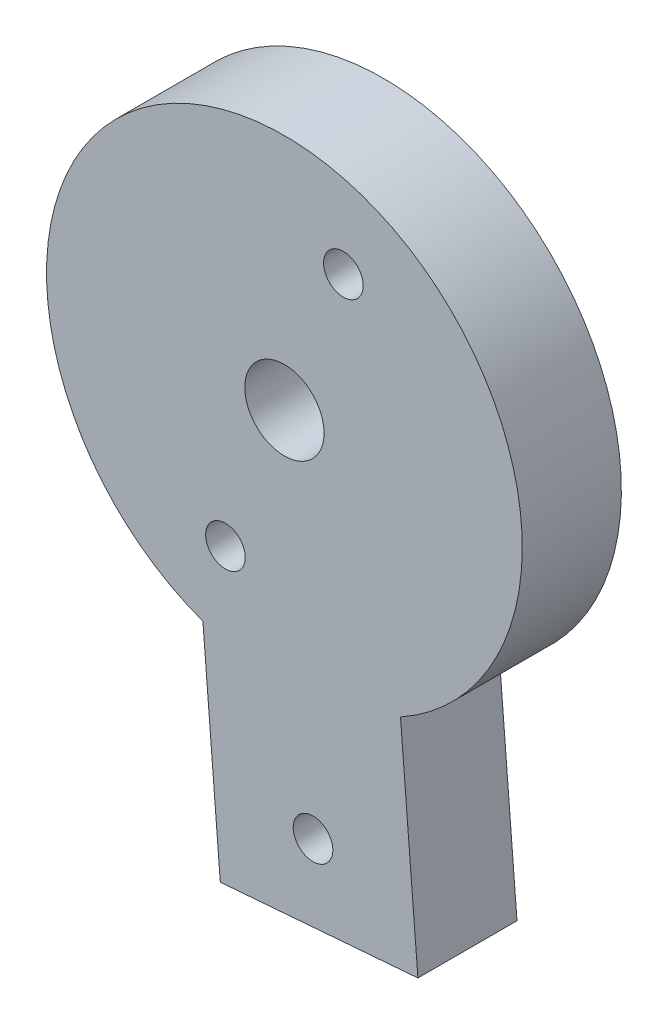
ISO-10303-21;
HEADER;
FILE_DESCRIPTION(('STEP AP214'),'2;1');
FILE_NAME('part.step','',(''),(''),'','','');
FILE_SCHEMA(('AUTOMOTIVE_DESIGN { 1 0 10303 214 1 1 1 1 }'));
ENDSEC;
DATA;
#1=APPLICATION_CONTEXT('core data for automotive mechanical design processes');
#2=APPLICATION_PROTOCOL_DEFINITION('international standard','automotive_design',2000,#1);
#3=PRODUCT_CONTEXT('',#1,'mechanical');
#4=PRODUCT('Part','Part','',(#3));
#5=PRODUCT_RELATED_PRODUCT_CATEGORY('part','',(#4));
#6=PRODUCT_DEFINITION_FORMATION('','',#4);
#7=PRODUCT_DEFINITION_CONTEXT('part definition',#1,'design');
#8=PRODUCT_DEFINITION('design','',#6,#7);
#9=PRODUCT_DEFINITION_SHAPE('','',#8);
#10=(LENGTH_UNIT() NAMED_UNIT(*) SI_UNIT(.MILLI.,.METRE.));
#11=(NAMED_UNIT(*) PLANE_ANGLE_UNIT() SI_UNIT($,.RADIAN.));
#12=(NAMED_UNIT(*) SI_UNIT($,.STERADIAN.) SOLID_ANGLE_UNIT());
#13=UNCERTAINTY_MEASURE_WITH_UNIT(LENGTH_MEASURE(1.E-05),#10,'distance_accuracy_value','');
#14=(GEOMETRIC_REPRESENTATION_CONTEXT(3) GLOBAL_UNCERTAINTY_ASSIGNED_CONTEXT((#13)) GLOBAL_UNIT_ASSIGNED_CONTEXT((#10,
#11,#12)) REPRESENTATION_CONTEXT('',''));
#15=CARTESIAN_POINT('',(0.,0.,0.));
#16=DIRECTION('',(0.,0.,1.));
#17=DIRECTION('',(1.,0.,0.));
#18=AXIS2_PLACEMENT_3D('',#15,#16,#17);
#19=CARTESIAN_POINT('',(0.,0.,5.));
#20=DIRECTION('',(0.,0.,-1.));
#21=DIRECTION('',(-1.,0.,0.));
#22=AXIS2_PLACEMENT_3D('',#19,#20,#21);
#23=CYLINDRICAL_SURFACE('',#22,12.);
#24=CARTESIAN_POINT('',(0.,0.,0.));
#25=DIRECTION('',(0.,0.,1.));
#26=DIRECTION('',(1.,0.,0.));
#27=AXIS2_PLACEMENT_3D('',#24,#25,#26);
#28=CIRCLE('',#27,12.);
#29=CARTESIAN_POINT('',(5.85565383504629,-10.4743170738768,0.));
#30=VERTEX_POINT('',#29);
#31=CARTESIAN_POINT('',(-4.11237246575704,-11.2733487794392,0.));
#32=VERTEX_POINT('',#31);
#33=EDGE_CURVE('E96',#30,#32,#28,.T.);
#34=ORIENTED_EDGE('',*,*,#33,.T.);
#35=DIRECTION('',(0.,0.,-1.));
#36=VECTOR('',#35,1.);
#37=CARTESIAN_POINT('',(-4.11237246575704,-11.2733487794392,5.));
#38=LINE('',#37,#36);
#39=CARTESIAN_POINT('',(-4.11237246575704,-11.2733487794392,5.));
#40=VERTEX_POINT('',#39);
#41=EDGE_CURVE('E11',#40,#32,#38,.T.);
#42=ORIENTED_EDGE('',*,*,#41,.F.);
#43=CARTESIAN_POINT('',(0.,0.,5.));
#44=DIRECTION('',(0.,0.,1.));
#45=DIRECTION('',(1.,0.,0.));
#46=AXIS2_PLACEMENT_3D('',#43,#44,#45);
#47=CIRCLE('',#46,12.);
#48=CARTESIAN_POINT('',(5.85565383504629,-10.4743170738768,5.));
#49=VERTEX_POINT('',#48);
#50=EDGE_CURVE('E84',#49,#40,#47,.T.);
#51=ORIENTED_EDGE('',*,*,#50,.F.);
#52=DIRECTION('',(0.,0.,-1.));
#53=VECTOR('',#52,1.);
#54=CARTESIAN_POINT('',(5.85565383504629,-10.4743170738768,5.));
#55=LINE('',#54,#53);
#56=EDGE_CURVE('E92',#49,#30,#55,.T.);
#57=ORIENTED_EDGE('',*,*,#56,.T.);
#58=EDGE_LOOP('',(#34,#42,#51,#57));
#59=FACE_BOUND('',#58,.T.);
#60=ADVANCED_FACE('F33',(#59),#23,.T.);
#61=CARTESIAN_POINT('',(-4.11237246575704,-11.2733487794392,5.));
#62=DIRECTION('',(0.996802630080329,0.079903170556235,0.));
#63=DIRECTION('',(-0.079903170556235,0.996802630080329,0.));
#64=AXIS2_PLACEMENT_3D('',#61,#62,#63);
#65=PLANE('',#64);
#66=DIRECTION('',(0.079903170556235,-0.996802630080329,0.));
#67=VECTOR('',#66,1.);
#68=CARTESIAN_POINT('',(-4.11237246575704,-11.2733487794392,0.));
#69=LINE('',#68,#67);
#70=CARTESIAN_POINT('',(-3.23343758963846,-22.2381777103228,0.));
#71=VERTEX_POINT('',#70);
#72=EDGE_CURVE('E88',#32,#71,#69,.T.);
#73=ORIENTED_EDGE('',*,*,#72,.T.);
#74=DIRECTION('',(0.,0.,-1.));
#75=VECTOR('',#74,1.);
#76=CARTESIAN_POINT('',(-3.23343758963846,-22.2381777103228,5.));
#77=LINE('',#76,#75);
#78=CARTESIAN_POINT('',(-3.23343758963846,-22.2381777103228,5.));
#79=VERTEX_POINT('',#78);
#80=EDGE_CURVE('E41',#79,#71,#77,.T.);
#81=ORIENTED_EDGE('',*,*,#80,.F.);
#82=DIRECTION('',(0.079903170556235,-0.996802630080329,0.));
#83=VECTOR('',#82,1.);
#84=CARTESIAN_POINT('',(-4.11237246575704,-11.2733487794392,5.));
#85=LINE('',#84,#83);
#86=EDGE_CURVE('E79',#40,#79,#85,.T.);
#87=ORIENTED_EDGE('',*,*,#86,.F.);
#88=ORIENTED_EDGE('',*,*,#41,.T.);
#89=EDGE_LOOP('',(#73,#81,#87,#88));
#90=FACE_BOUND('',#89,.T.);
#91=ADVANCED_FACE('F87',(#90),#65,.F.);
#92=CARTESIAN_POINT('',(-3.23343758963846,-22.2381777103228,5.));
#93=DIRECTION('',(-0.0799031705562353,0.996802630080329,0.));
#94=DIRECTION('',(-0.996802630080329,-0.0799031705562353,0.));
#95=AXIS2_PLACEMENT_3D('',#92,#93,#94);
#96=PLANE('',#95);
#97=DIRECTION('',(0.996802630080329,0.0799031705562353,0.));
#98=VECTOR('',#97,1.);
#99=CARTESIAN_POINT('',(-3.23343758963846,-22.2381777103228,0.));
#100=LINE('',#99,#98);
#101=CARTESIAN_POINT('',(6.73458871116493,-21.4391460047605,0.));
#102=VERTEX_POINT('',#101);
#103=EDGE_CURVE('E66',#71,#102,#100,.T.);
#104=ORIENTED_EDGE('',*,*,#103,.T.);
#105=DIRECTION('',(0.,0.,-1.));
#106=VECTOR('',#105,1.);
#107=CARTESIAN_POINT('',(6.73458871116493,-21.4391460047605,5.));
#108=LINE('',#107,#106);
#109=CARTESIAN_POINT('',(6.73458871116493,-21.4391460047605,5.));
#110=VERTEX_POINT('',#109);
#111=EDGE_CURVE('E89',#110,#102,#108,.T.);
#112=ORIENTED_EDGE('',*,*,#111,.F.);
#113=DIRECTION('',(0.996802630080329,0.0799031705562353,0.));
#114=VECTOR('',#113,1.);
#115=CARTESIAN_POINT('',(-3.23343758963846,-22.2381777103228,5.));
#116=LINE('',#115,#114);
#117=EDGE_CURVE('E82',#79,#110,#116,.T.);
#118=ORIENTED_EDGE('',*,*,#117,.F.);
#119=ORIENTED_EDGE('',*,*,#80,.T.);
#120=EDGE_LOOP('',(#104,#112,#118,#119));
#121=FACE_BOUND('',#120,.T.);
#122=ADVANCED_FACE('F90',(#121),#96,.F.);
#123=CARTESIAN_POINT('',(6.73458871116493,-21.4391460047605,5.));
#124=DIRECTION('',(-0.996802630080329,-0.0799031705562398,0.));
#125=DIRECTION('',(0.0799031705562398,-0.996802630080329,0.));
#126=AXIS2_PLACEMENT_3D('',#123,#124,#125);
#127=PLANE('',#126);
#128=DIRECTION('',(-0.0799031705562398,0.996802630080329,0.));
#129=VECTOR('',#128,1.);
#130=CARTESIAN_POINT('',(6.73458871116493,-21.4391460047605,0.));
#131=LINE('',#130,#129);
#132=EDGE_CURVE('E72',#102,#30,#131,.T.);
#133=ORIENTED_EDGE('',*,*,#132,.T.);
#134=ORIENTED_EDGE('',*,*,#56,.F.);
#135=DIRECTION('',(-0.0799031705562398,0.996802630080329,0.));
#136=VECTOR('',#135,1.);
#137=CARTESIAN_POINT('',(6.73458871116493,-21.4391460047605,5.));
#138=LINE('',#137,#136);
#139=EDGE_CURVE('E49',#110,#49,#138,.T.);
#140=ORIENTED_EDGE('',*,*,#139,.F.);
#141=ORIENTED_EDGE('',*,*,#111,.T.);
#142=EDGE_LOOP('',(#133,#134,#140,#141));
#143=FACE_BOUND('',#142,.T.);
#144=ADVANCED_FACE('F104',(#143),#127,.F.);
#145=CARTESIAN_POINT('',(0.,0.,5.));
#146=DIRECTION('',(0.,0.,1.));
#147=DIRECTION('',(1.,0.,0.));
#148=AXIS2_PLACEMENT_3D('',#145,#146,#147);
#149=PLANE('',#148);
#150=CARTESIAN_POINT('',(-2.97483150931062,-7.42633001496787,5.));
#151=DIRECTION('',(0.,0.,1.));
#152=DIRECTION('',(1.,0.,0.));
#153=AXIS2_PLACEMENT_3D('',#150,#151,#152);
#154=CIRCLE('',#153,1.);
#155=CARTESIAN_POINT('',(-1.97483150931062,-7.42633001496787,5.));
#156=VERTEX_POINT('',#155);
#157=EDGE_CURVE('E128',#156,#156,#154,.T.);
#158=ORIENTED_EDGE('',*,*,#157,.F.);
#159=EDGE_LOOP('',(#158));
#160=FACE_BOUND('',#159,.T.);
#161=CARTESIAN_POINT('',(2.97483150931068,7.42633001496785,5.));
#162=DIRECTION('',(0.,0.,1.));
#163=DIRECTION('',(1.,0.,0.));
#164=AXIS2_PLACEMENT_3D('',#161,#162,#163);
#165=CIRCLE('',#164,1.);
#166=CARTESIAN_POINT('',(3.97483150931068,7.42633001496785,5.));
#167=VERTEX_POINT('',#166);
#168=EDGE_CURVE('E122',#167,#167,#165,.T.);
#169=ORIENTED_EDGE('',*,*,#168,.F.);
#170=EDGE_LOOP('',(#169));
#171=FACE_BOUND('',#170,.T.);
#172=CARTESIAN_POINT('',(1.44312317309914,-18.0031526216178,5.));
#173=DIRECTION('',(0.,0.,1.));
#174=DIRECTION('',(1.,0.,0.));
#175=AXIS2_PLACEMENT_3D('',#172,#173,#174);
#176=CIRCLE('',#175,1.);
#177=CARTESIAN_POINT('',(2.44312317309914,-18.0031526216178,5.));
#178=VERTEX_POINT('',#177);
#179=EDGE_CURVE('E116',#178,#178,#176,.T.);
#180=ORIENTED_EDGE('',*,*,#179,.F.);
#181=EDGE_LOOP('',(#180));
#182=FACE_BOUND('',#181,.T.);
#183=CARTESIAN_POINT('',(0.,0.,5.));
#184=DIRECTION('',(0.,0.,1.));
#185=DIRECTION('',(1.,0.,0.));
#186=AXIS2_PLACEMENT_3D('',#183,#184,#185);
#187=CIRCLE('',#186,2.);
#188=CARTESIAN_POINT('',(2.,0.,5.));
#189=VERTEX_POINT('',#188);
#190=EDGE_CURVE('E110',#189,#189,#187,.T.);
#191=ORIENTED_EDGE('',*,*,#190,.F.);
#192=EDGE_LOOP('',(#191));
#193=FACE_BOUND('',#192,.T.);
#194=ORIENTED_EDGE('',*,*,#50,.T.);
#195=ORIENTED_EDGE('',*,*,#86,.T.);
#196=ORIENTED_EDGE('',*,*,#117,.T.);
#197=ORIENTED_EDGE('',*,*,#139,.T.);
#198=EDGE_LOOP('',(#194,#195,#196,#197));
#199=FACE_BOUND('',#198,.T.);
#200=ADVANCED_FACE('F80',(#160,#171,#182,#193,#199),#149,.T.);
#201=CARTESIAN_POINT('',(0.,0.,0.));
#202=DIRECTION('',(0.,0.,1.));
#203=DIRECTION('',(1.,0.,0.));
#204=AXIS2_PLACEMENT_3D('',#201,#202,#203);
#205=PLANE('',#204);
#206=CARTESIAN_POINT('',(-2.97483150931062,-7.42633001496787,0.));
#207=DIRECTION('',(0.,0.,1.));
#208=DIRECTION('',(1.,0.,0.));
#209=AXIS2_PLACEMENT_3D('',#206,#207,#208);
#210=CIRCLE('',#209,1.);
#211=CARTESIAN_POINT('',(-1.97483150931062,-7.42633001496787,0.));
#212=VERTEX_POINT('',#211);
#213=EDGE_CURVE('E125',#212,#212,#210,.T.);
#214=ORIENTED_EDGE('',*,*,#213,.T.);
#215=EDGE_LOOP('',(#214));
#216=FACE_BOUND('',#215,.T.);
#217=CARTESIAN_POINT('',(2.97483150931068,7.42633001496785,0.));
#218=DIRECTION('',(0.,0.,1.));
#219=DIRECTION('',(1.,0.,0.));
#220=AXIS2_PLACEMENT_3D('',#217,#218,#219);
#221=CIRCLE('',#220,1.);
#222=CARTESIAN_POINT('',(3.97483150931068,7.42633001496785,0.));
#223=VERTEX_POINT('',#222);
#224=EDGE_CURVE('E119',#223,#223,#221,.T.);
#225=ORIENTED_EDGE('',*,*,#224,.T.);
#226=EDGE_LOOP('',(#225));
#227=FACE_BOUND('',#226,.T.);
#228=CARTESIAN_POINT('',(1.44312317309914,-18.0031526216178,0.));
#229=DIRECTION('',(0.,0.,1.));
#230=DIRECTION('',(1.,0.,0.));
#231=AXIS2_PLACEMENT_3D('',#228,#229,#230);
#232=CIRCLE('',#231,1.);
#233=CARTESIAN_POINT('',(2.44312317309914,-18.0031526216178,0.));
#234=VERTEX_POINT('',#233);
#235=EDGE_CURVE('E113',#234,#234,#232,.T.);
#236=ORIENTED_EDGE('',*,*,#235,.T.);
#237=EDGE_LOOP('',(#236));
#238=FACE_BOUND('',#237,.T.);
#239=CARTESIAN_POINT('',(0.,0.,0.));
#240=DIRECTION('',(0.,0.,1.));
#241=DIRECTION('',(1.,0.,0.));
#242=AXIS2_PLACEMENT_3D('',#239,#240,#241);
#243=CIRCLE('',#242,2.);
#244=CARTESIAN_POINT('',(2.,0.,0.));
#245=VERTEX_POINT('',#244);
#246=EDGE_CURVE('E99',#245,#245,#243,.T.);
#247=ORIENTED_EDGE('',*,*,#246,.T.);
#248=EDGE_LOOP('',(#247));
#249=FACE_BOUND('',#248,.T.);
#250=ORIENTED_EDGE('',*,*,#33,.F.);
#251=ORIENTED_EDGE('',*,*,#132,.F.);
#252=ORIENTED_EDGE('',*,*,#103,.F.);
#253=ORIENTED_EDGE('',*,*,#72,.F.);
#254=EDGE_LOOP('',(#250,#251,#252,#253));
#255=FACE_BOUND('',#254,.T.);
#256=ADVANCED_FACE('F107',(#216,#227,#238,#249,#255),#205,.F.);
#257=CARTESIAN_POINT('',(0.,0.,0.));
#258=DIRECTION('',(0.,0.,1.));
#259=DIRECTION('',(1.,0.,0.));
#260=AXIS2_PLACEMENT_3D('',#257,#258,#259);
#261=CYLINDRICAL_SURFACE('',#260,2.);
#262=ORIENTED_EDGE('',*,*,#246,.F.);
#263=EDGE_LOOP('',(#262));
#264=FACE_BOUND('',#263,.T.);
#265=ORIENTED_EDGE('',*,*,#190,.T.);
#266=EDGE_LOOP('',(#265));
#267=FACE_BOUND('',#266,.T.);
#268=ADVANCED_FACE('F152',(#264,#267),#261,.F.);
#269=CARTESIAN_POINT('',(1.44312317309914,-18.0031526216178,0.));
#270=DIRECTION('',(0.,0.,1.));
#271=DIRECTION('',(1.,0.,0.));
#272=AXIS2_PLACEMENT_3D('',#269,#270,#271);
#273=CYLINDRICAL_SURFACE('',#272,1.);
#274=ORIENTED_EDGE('',*,*,#235,.F.);
#275=EDGE_LOOP('',(#274));
#276=FACE_BOUND('',#275,.T.);
#277=ORIENTED_EDGE('',*,*,#179,.T.);
#278=EDGE_LOOP('',(#277));
#279=FACE_BOUND('',#278,.T.);
#280=ADVANCED_FACE('F154',(#276,#279),#273,.F.);
#281=CARTESIAN_POINT('',(2.97483150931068,7.42633001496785,0.));
#282=DIRECTION('',(0.,0.,1.));
#283=DIRECTION('',(1.,0.,0.));
#284=AXIS2_PLACEMENT_3D('',#281,#282,#283);
#285=CYLINDRICAL_SURFACE('',#284,1.);
#286=ORIENTED_EDGE('',*,*,#224,.F.);
#287=EDGE_LOOP('',(#286));
#288=FACE_BOUND('',#287,.T.);
#289=ORIENTED_EDGE('',*,*,#168,.T.);
#290=EDGE_LOOP('',(#289));
#291=FACE_BOUND('',#290,.T.);
#292=ADVANCED_FACE('F139',(#288,#291),#285,.F.);
#293=CARTESIAN_POINT('',(-2.97483150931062,-7.42633001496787,0.));
#294=DIRECTION('',(0.,0.,1.));
#295=DIRECTION('',(1.,0.,0.));
#296=AXIS2_PLACEMENT_3D('',#293,#294,#295);
#297=CYLINDRICAL_SURFACE('',#296,1.);
#298=ORIENTED_EDGE('',*,*,#213,.F.);
#299=EDGE_LOOP('',(#298));
#300=FACE_BOUND('',#299,.T.);
#301=ORIENTED_EDGE('',*,*,#157,.T.);
#302=EDGE_LOOP('',(#301));
#303=FACE_BOUND('',#302,.T.);
#304=ADVANCED_FACE('F136',(#300,#303),#297,.F.);
#305=CLOSED_SHELL('',(#60,#91,#122,#144,#200,#256,#268,#280,#292,#304));
#306=MANIFOLD_SOLID_BREP('B2',#305);
#307=ADVANCED_BREP_SHAPE_REPRESENTATION('',(#18,#306),#14);
#308=SHAPE_DEFINITION_REPRESENTATION(#9,#307);
ENDSEC;
END-ISO-10303-21;
